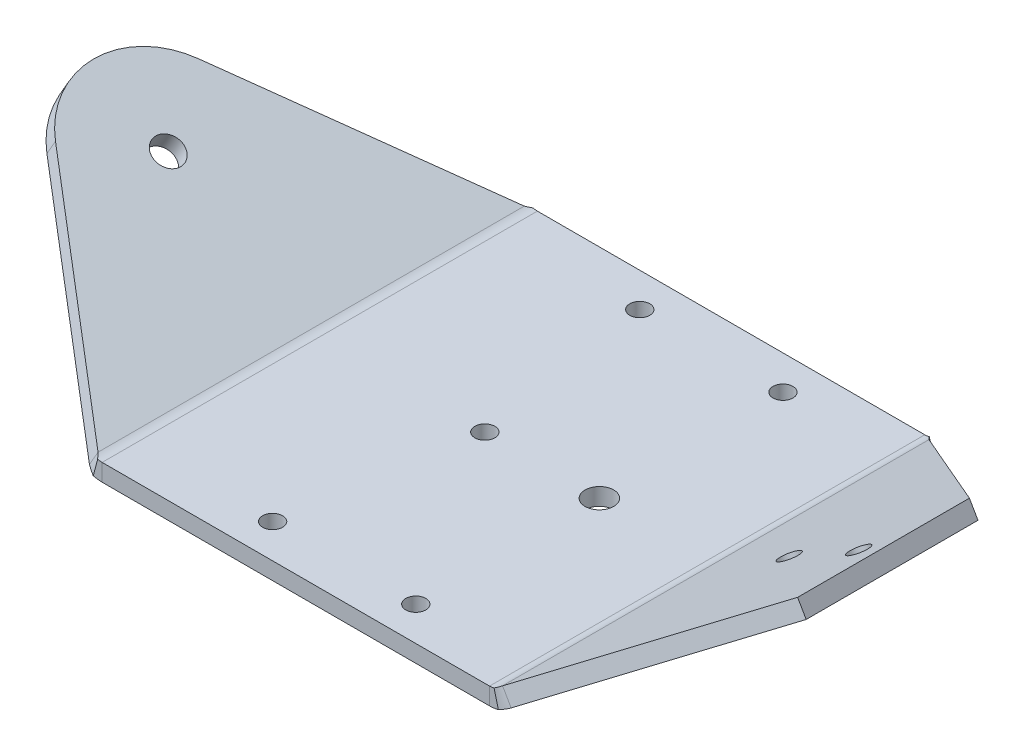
ISO-10303-21;
HEADER;
FILE_DESCRIPTION(('STEP AP214'),'2;1');
FILE_NAME('part.step','',(''),(''),'','','');
FILE_SCHEMA(('AUTOMOTIVE_DESIGN { 1 0 10303 214 1 1 1 1 }'));
ENDSEC;
DATA;
#1=APPLICATION_CONTEXT('core data for automotive mechanical design processes');
#2=APPLICATION_PROTOCOL_DEFINITION('international standard','automotive_design',2000,#1);
#3=PRODUCT_CONTEXT('',#1,'mechanical');
#4=PRODUCT('Part','Part','',(#3));
#5=PRODUCT_RELATED_PRODUCT_CATEGORY('part','',(#4));
#6=PRODUCT_DEFINITION_FORMATION('','',#4);
#7=PRODUCT_DEFINITION_CONTEXT('part definition',#1,'design');
#8=PRODUCT_DEFINITION('design','',#6,#7);
#9=PRODUCT_DEFINITION_SHAPE('','',#8);
#10=(LENGTH_UNIT() NAMED_UNIT(*) SI_UNIT(.MILLI.,.METRE.));
#11=(NAMED_UNIT(*) PLANE_ANGLE_UNIT() SI_UNIT($,.RADIAN.));
#12=(NAMED_UNIT(*) SI_UNIT($,.STERADIAN.) SOLID_ANGLE_UNIT());
#13=UNCERTAINTY_MEASURE_WITH_UNIT(LENGTH_MEASURE(1.E-05),#10,'distance_accuracy_value','');
#14=(GEOMETRIC_REPRESENTATION_CONTEXT(3) GLOBAL_UNCERTAINTY_ASSIGNED_CONTEXT((#13)) GLOBAL_UNIT_ASSIGNED_CONTEXT((#10,
#11,#12)) REPRESENTATION_CONTEXT('',''));
#15=CARTESIAN_POINT('',(0.,0.,0.));
#16=DIRECTION('',(0.,0.,1.));
#17=DIRECTION('',(1.,0.,0.));
#18=AXIS2_PLACEMENT_3D('',#15,#16,#17);
#19=CARTESIAN_POINT('',(0.,3.,0.));
#20=DIRECTION('',(0.,1.,0.));
#21=DIRECTION('',(0.,0.,1.));
#22=AXIS2_PLACEMENT_3D('',#19,#20,#21);
#23=PLANE('',#22);
#24=CARTESIAN_POINT('',(54.9999485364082,3.,32.055));
#25=DIRECTION('',(0.,1.,0.));
#26=DIRECTION('',(0.,0.,1.));
#27=AXIS2_PLACEMENT_3D('',#24,#25,#26);
#28=CIRCLE('',#27,1.75);
#29=CARTESIAN_POINT('',(54.9999485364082,3.,33.805));
#30=VERTEX_POINT('',#29);
#31=EDGE_CURVE('E629',#30,#30,#28,.T.);
#32=ORIENTED_EDGE('',*,*,#31,.F.);
#33=EDGE_LOOP('',(#32));
#34=FACE_BOUND('',#33,.T.);
#35=CARTESIAN_POINT('',(79.9999485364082,3.,0.));
#36=DIRECTION('',(0.,1.,0.));
#37=DIRECTION('',(0.,0.,1.));
#38=AXIS2_PLACEMENT_3D('',#35,#36,#37);
#39=CIRCLE('',#38,2.50000000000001);
#40=CARTESIAN_POINT('',(79.9999485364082,3.,2.50000000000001));
#41=VERTEX_POINT('',#40);
#42=EDGE_CURVE('E633',#41,#41,#39,.T.);
#43=ORIENTED_EDGE('',*,*,#42,.F.);
#44=EDGE_LOOP('',(#43));
#45=FACE_BOUND('',#44,.T.);
#46=CARTESIAN_POINT('',(59.9999485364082,3.,0.));
#47=DIRECTION('',(0.,1.,0.));
#48=DIRECTION('',(0.,0.,1.));
#49=AXIS2_PLACEMENT_3D('',#46,#47,#48);
#50=CIRCLE('',#49,1.75);
#51=CARTESIAN_POINT('',(59.9999485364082,3.,1.75));
#52=VERTEX_POINT('',#51);
#53=EDGE_CURVE('E637',#52,#52,#50,.T.);
#54=ORIENTED_EDGE('',*,*,#53,.F.);
#55=EDGE_LOOP('',(#54));
#56=FACE_BOUND('',#55,.T.);
#57=CARTESIAN_POINT('',(54.9999485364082,3.,-32.055));
#58=DIRECTION('',(0.,1.,0.));
#59=DIRECTION('',(0.,0.,1.));
#60=AXIS2_PLACEMENT_3D('',#57,#58,#59);
#61=CIRCLE('',#60,1.75);
#62=CARTESIAN_POINT('',(54.9999485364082,3.,-30.305));
#63=VERTEX_POINT('',#62);
#64=EDGE_CURVE('E641',#63,#63,#61,.T.);
#65=ORIENTED_EDGE('',*,*,#64,.F.);
#66=EDGE_LOOP('',(#65));
#67=FACE_BOUND('',#66,.T.);
#68=CARTESIAN_POINT('',(79.9999485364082,3.,-32.055));
#69=DIRECTION('',(0.,1.,0.));
#70=DIRECTION('',(0.,0.,1.));
#71=AXIS2_PLACEMENT_3D('',#68,#69,#70);
#72=CIRCLE('',#71,1.75);
#73=CARTESIAN_POINT('',(79.9999485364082,3.,-30.305));
#74=VERTEX_POINT('',#73);
#75=EDGE_CURVE('E645',#74,#74,#72,.T.);
#76=ORIENTED_EDGE('',*,*,#75,.F.);
#77=EDGE_LOOP('',(#76));
#78=FACE_BOUND('',#77,.T.);
#79=CARTESIAN_POINT('',(79.9999485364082,3.,32.055));
#80=DIRECTION('',(0.,1.,0.));
#81=DIRECTION('',(0.,0.,1.));
#82=AXIS2_PLACEMENT_3D('',#79,#80,#81);
#83=CIRCLE('',#82,1.75);
#84=CARTESIAN_POINT('',(79.9999485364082,3.,33.805));
#85=VERTEX_POINT('',#84);
#86=EDGE_CURVE('E649',#85,#85,#83,.T.);
#87=ORIENTED_EDGE('',*,*,#86,.F.);
#88=EDGE_LOOP('',(#87));
#89=FACE_BOUND('',#88,.T.);
#90=DIRECTION('',(1.,0.,0.));
#91=VECTOR('',#90,1.);
#92=CARTESIAN_POINT('',(29.9999485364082,3.,38.0000772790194));
#93=LINE('',#92,#91);
#94=CARTESIAN_POINT('',(31.1780457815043,3.00000002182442,38.0000772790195));
#95=VERTEX_POINT('',#94);
#96=CARTESIAN_POINT('',(98.821851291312,3.,38.0000772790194));
#97=VERTEX_POINT('',#96);
#98=EDGE_CURVE('E652',#95,#97,#93,.T.);
#99=ORIENTED_EDGE('',*,*,#98,.T.);
#100=DIRECTION('',(0.,0.,-1.));
#101=VECTOR('',#100,1.);
#102=CARTESIAN_POINT('',(98.821851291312,3.,0.));
#103=LINE('',#102,#101);
#104=CARTESIAN_POINT('',(98.821851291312,2.99999993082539,-38.0000772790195));
#105=VERTEX_POINT('',#104);
#106=EDGE_CURVE('E443',#97,#105,#103,.T.);
#107=ORIENTED_EDGE('',*,*,#106,.T.);
#108=DIRECTION('',(-1.,0.,0.));
#109=VECTOR('',#108,1.);
#110=CARTESIAN_POINT('',(29.9999485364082,3.,-38.0000772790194));
#111=LINE('',#110,#109);
#112=CARTESIAN_POINT('',(31.1780457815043,3.,-38.0000772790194));
#113=VERTEX_POINT('',#112);
#114=EDGE_CURVE('E657',#105,#113,#111,.T.);
#115=ORIENTED_EDGE('',*,*,#114,.T.);
#116=DIRECTION('',(0.,0.,1.));
#117=VECTOR('',#116,1.);
#118=CARTESIAN_POINT('',(31.1780457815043,3.,0.));
#119=LINE('',#118,#117);
#120=EDGE_CURVE('E655',#113,#95,#119,.T.);
#121=ORIENTED_EDGE('',*,*,#120,.T.);
#122=EDGE_LOOP('',(#99,#107,#115,#121));
#123=FACE_BOUND('',#122,.T.);
#124=ADVANCED_FACE('F70',(#34,#45,#56,#67,#78,#89,#123),#23,.T.);
#125=CARTESIAN_POINT('',(0.,0.,0.));
#126=DIRECTION('',(0.,1.,0.));
#127=DIRECTION('',(0.,0.,1.));
#128=AXIS2_PLACEMENT_3D('',#125,#126,#127);
#129=PLANE('',#128);
#130=DIRECTION('',(0.,0.,-1.));
#131=VECTOR('',#130,1.);
#132=CARTESIAN_POINT('',(98.821851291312,0.,0.));
#133=LINE('',#132,#131);
#134=CARTESIAN_POINT('',(98.821851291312,0.,38.0000772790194));
#135=VERTEX_POINT('',#134);
#136=CARTESIAN_POINT('',(98.821851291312,0.,-38.0000772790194));
#137=VERTEX_POINT('',#136);
#138=EDGE_CURVE('E81',#135,#137,#133,.T.);
#139=ORIENTED_EDGE('',*,*,#138,.F.);
#140=DIRECTION('',(1.,0.,0.));
#141=VECTOR('',#140,1.);
#142=CARTESIAN_POINT('',(29.9999485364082,0.,38.0000772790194));
#143=LINE('',#142,#141);
#144=CARTESIAN_POINT('',(31.1780457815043,0.,38.0000772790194));
#145=VERTEX_POINT('',#144);
#146=EDGE_CURVE('E97',#145,#135,#143,.T.);
#147=ORIENTED_EDGE('',*,*,#146,.F.);
#148=DIRECTION('',(0.,0.,1.));
#149=VECTOR('',#148,1.);
#150=CARTESIAN_POINT('',(31.1780457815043,0.,0.));
#151=LINE('',#150,#149);
#152=CARTESIAN_POINT('',(31.1780457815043,0.,-38.0000772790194));
#153=VERTEX_POINT('',#152);
#154=EDGE_CURVE('E978',#153,#145,#151,.T.);
#155=ORIENTED_EDGE('',*,*,#154,.F.);
#156=DIRECTION('',(-1.,0.,0.));
#157=VECTOR('',#156,1.);
#158=CARTESIAN_POINT('',(29.9999485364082,0.,-38.0000772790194));
#159=LINE('',#158,#157);
#160=EDGE_CURVE('E89',#137,#153,#159,.T.);
#161=ORIENTED_EDGE('',*,*,#160,.F.);
#162=EDGE_LOOP('',(#139,#147,#155,#161));
#163=FACE_BOUND('',#162,.T.);
#164=CARTESIAN_POINT('',(54.9999485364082,0.,32.055));
#165=DIRECTION('',(0.,1.,0.));
#166=DIRECTION('',(0.,0.,1.));
#167=AXIS2_PLACEMENT_3D('',#164,#165,#166);
#168=CIRCLE('',#167,1.75);
#169=CARTESIAN_POINT('',(54.9999485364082,0.,33.805));
#170=VERTEX_POINT('',#169);
#171=EDGE_CURVE('E1173',#170,#170,#168,.T.);
#172=ORIENTED_EDGE('',*,*,#171,.T.);
#173=EDGE_LOOP('',(#172));
#174=FACE_BOUND('',#173,.T.);
#175=CARTESIAN_POINT('',(79.9999485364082,0.,0.));
#176=DIRECTION('',(0.,1.,0.));
#177=DIRECTION('',(0.,0.,1.));
#178=AXIS2_PLACEMENT_3D('',#175,#176,#177);
#179=CIRCLE('',#178,2.50000000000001);
#180=CARTESIAN_POINT('',(79.9999485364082,0.,2.50000000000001));
#181=VERTEX_POINT('',#180);
#182=EDGE_CURVE('E1161',#181,#181,#179,.T.);
#183=ORIENTED_EDGE('',*,*,#182,.T.);
#184=EDGE_LOOP('',(#183));
#185=FACE_BOUND('',#184,.T.);
#186=CARTESIAN_POINT('',(59.9999485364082,0.,0.));
#187=DIRECTION('',(0.,1.,0.));
#188=DIRECTION('',(0.,0.,1.));
#189=AXIS2_PLACEMENT_3D('',#186,#187,#188);
#190=CIRCLE('',#189,1.75);
#191=CARTESIAN_POINT('',(59.9999485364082,0.,1.75));
#192=VERTEX_POINT('',#191);
#193=EDGE_CURVE('E1155',#192,#192,#190,.T.);
#194=ORIENTED_EDGE('',*,*,#193,.T.);
#195=EDGE_LOOP('',(#194));
#196=FACE_BOUND('',#195,.T.);
#197=CARTESIAN_POINT('',(54.9999485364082,0.,-32.055));
#198=DIRECTION('',(0.,1.,0.));
#199=DIRECTION('',(0.,0.,1.));
#200=AXIS2_PLACEMENT_3D('',#197,#198,#199);
#201=CIRCLE('',#200,1.75);
#202=CARTESIAN_POINT('',(54.9999485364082,0.,-30.305));
#203=VERTEX_POINT('',#202);
#204=EDGE_CURVE('E1165',#203,#203,#201,.T.);
#205=ORIENTED_EDGE('',*,*,#204,.T.);
#206=EDGE_LOOP('',(#205));
#207=FACE_BOUND('',#206,.T.);
#208=CARTESIAN_POINT('',(79.9999485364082,0.,-32.055));
#209=DIRECTION('',(0.,1.,0.));
#210=DIRECTION('',(0.,0.,1.));
#211=AXIS2_PLACEMENT_3D('',#208,#209,#210);
#212=CIRCLE('',#211,1.75);
#213=CARTESIAN_POINT('',(79.9999485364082,0.,-30.305));
#214=VERTEX_POINT('',#213);
#215=EDGE_CURVE('E1169',#214,#214,#212,.T.);
#216=ORIENTED_EDGE('',*,*,#215,.T.);
#217=EDGE_LOOP('',(#216));
#218=FACE_BOUND('',#217,.T.);
#219=CARTESIAN_POINT('',(79.9999485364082,0.,32.055));
#220=DIRECTION('',(0.,1.,0.));
#221=DIRECTION('',(0.,0.,1.));
#222=AXIS2_PLACEMENT_3D('',#219,#220,#221);
#223=CIRCLE('',#222,1.75);
#224=CARTESIAN_POINT('',(79.9999485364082,0.,33.805));
#225=VERTEX_POINT('',#224);
#226=EDGE_CURVE('E581',#225,#225,#223,.T.);
#227=ORIENTED_EDGE('',*,*,#226,.T.);
#228=EDGE_LOOP('',(#227));
#229=FACE_BOUND('',#228,.T.);
#230=ADVANCED_FACE('F72',(#163,#174,#185,#196,#207,#218,#229),#129,.F.);
#231=CARTESIAN_POINT('',(29.9999485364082,3.,38.0000772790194));
#232=DIRECTION('',(0.,0.,-1.));
#233=DIRECTION('',(-1.,0.,0.));
#234=AXIS2_PLACEMENT_3D('',#231,#232,#233);
#235=PLANE('',#234);
#236=DIRECTION('',(0.,-1.,0.));
#237=VECTOR('',#236,1.);
#238=CARTESIAN_POINT('',(98.821851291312,3.,38.0000772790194));
#239=LINE('',#238,#237);
#240=EDGE_CURVE('E660',#97,#135,#239,.T.);
#241=ORIENTED_EDGE('',*,*,#240,.F.);
#242=ORIENTED_EDGE('',*,*,#98,.F.);
#243=DIRECTION('',(0.,1.,0.));
#244=VECTOR('',#243,1.);
#245=CARTESIAN_POINT('',(31.1780457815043,3.,38.0000772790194));
#246=LINE('',#245,#244);
#247=EDGE_CURVE('E663',#145,#95,#246,.T.);
#248=ORIENTED_EDGE('',*,*,#247,.F.);
#249=ORIENTED_EDGE('',*,*,#146,.T.);
#250=EDGE_LOOP('',(#241,#242,#248,#249));
#251=FACE_BOUND('',#250,.T.);
#252=ADVANCED_FACE('F616',(#251),#235,.F.);
#253=CARTESIAN_POINT('',(29.9999485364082,3.,-38.0000772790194));
#254=DIRECTION('',(0.,0.,1.));
#255=DIRECTION('',(1.,0.,0.));
#256=AXIS2_PLACEMENT_3D('',#253,#254,#255);
#257=PLANE('',#256);
#258=DIRECTION('',(0.,1.,0.));
#259=VECTOR('',#258,1.);
#260=CARTESIAN_POINT('',(98.821851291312,3.,-38.0000772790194));
#261=LINE('',#260,#259);
#262=EDGE_CURVE('E12',#137,#105,#261,.T.);
#263=ORIENTED_EDGE('',*,*,#262,.F.);
#264=ORIENTED_EDGE('',*,*,#160,.T.);
#265=DIRECTION('',(0.,-1.,0.));
#266=VECTOR('',#265,1.);
#267=CARTESIAN_POINT('',(31.1780457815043,3.,-38.0000772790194));
#268=LINE('',#267,#266);
#269=EDGE_CURVE('E975',#113,#153,#268,.T.);
#270=ORIENTED_EDGE('',*,*,#269,.F.);
#271=ORIENTED_EDGE('',*,*,#114,.F.);
#272=EDGE_LOOP('',(#263,#264,#270,#271));
#273=FACE_BOUND('',#272,.T.);
#274=ADVANCED_FACE('F614',(#273),#257,.F.);
#275=CARTESIAN_POINT('',(59.9999485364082,3.,0.));
#276=DIRECTION('',(0.,-1.,0.));
#277=DIRECTION('',(0.,0.,-1.));
#278=AXIS2_PLACEMENT_3D('',#275,#276,#277);
#279=CYLINDRICAL_SURFACE('',#278,1.75);
#280=ORIENTED_EDGE('',*,*,#53,.T.);
#281=EDGE_LOOP('',(#280));
#282=FACE_BOUND('',#281,.T.);
#283=ORIENTED_EDGE('',*,*,#193,.F.);
#284=EDGE_LOOP('',(#283));
#285=FACE_BOUND('',#284,.T.);
#286=ADVANCED_FACE('F610',(#282,#285),#279,.F.);
#287=CARTESIAN_POINT('',(79.9999485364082,3.,0.));
#288=DIRECTION('',(0.,-1.,0.));
#289=DIRECTION('',(0.,0.,-1.));
#290=AXIS2_PLACEMENT_3D('',#287,#288,#289);
#291=CYLINDRICAL_SURFACE('',#290,2.50000000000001);
#292=ORIENTED_EDGE('',*,*,#42,.T.);
#293=EDGE_LOOP('',(#292));
#294=FACE_BOUND('',#293,.T.);
#295=ORIENTED_EDGE('',*,*,#182,.F.);
#296=EDGE_LOOP('',(#295));
#297=FACE_BOUND('',#296,.T.);
#298=ADVANCED_FACE('F606',(#294,#297),#291,.F.);
#299=CARTESIAN_POINT('',(54.9999485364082,3.,-32.055));
#300=DIRECTION('',(0.,-1.,0.));
#301=DIRECTION('',(0.,0.,-1.));
#302=AXIS2_PLACEMENT_3D('',#299,#300,#301);
#303=CYLINDRICAL_SURFACE('',#302,1.75);
#304=ORIENTED_EDGE('',*,*,#64,.T.);
#305=EDGE_LOOP('',(#304));
#306=FACE_BOUND('',#305,.T.);
#307=ORIENTED_EDGE('',*,*,#204,.F.);
#308=EDGE_LOOP('',(#307));
#309=FACE_BOUND('',#308,.T.);
#310=ADVANCED_FACE('F602',(#306,#309),#303,.F.);
#311=CARTESIAN_POINT('',(79.9999485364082,3.,-32.055));
#312=DIRECTION('',(0.,-1.,0.));
#313=DIRECTION('',(0.,0.,-1.));
#314=AXIS2_PLACEMENT_3D('',#311,#312,#313);
#315=CYLINDRICAL_SURFACE('',#314,1.75);
#316=ORIENTED_EDGE('',*,*,#75,.T.);
#317=EDGE_LOOP('',(#316));
#318=FACE_BOUND('',#317,.T.);
#319=ORIENTED_EDGE('',*,*,#215,.F.);
#320=EDGE_LOOP('',(#319));
#321=FACE_BOUND('',#320,.T.);
#322=ADVANCED_FACE('F598',(#318,#321),#315,.F.);
#323=CARTESIAN_POINT('',(54.9999485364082,3.,32.055));
#324=DIRECTION('',(0.,-1.,0.));
#325=DIRECTION('',(0.,0.,-1.));
#326=AXIS2_PLACEMENT_3D('',#323,#324,#325);
#327=CYLINDRICAL_SURFACE('',#326,1.75);
#328=ORIENTED_EDGE('',*,*,#31,.T.);
#329=EDGE_LOOP('',(#328));
#330=FACE_BOUND('',#329,.T.);
#331=ORIENTED_EDGE('',*,*,#171,.F.);
#332=EDGE_LOOP('',(#331));
#333=FACE_BOUND('',#332,.T.);
#334=ADVANCED_FACE('F594',(#330,#333),#327,.F.);
#335=CARTESIAN_POINT('',(79.9999485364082,3.,32.055));
#336=DIRECTION('',(0.,-1.,0.));
#337=DIRECTION('',(0.,0.,-1.));
#338=AXIS2_PLACEMENT_3D('',#335,#336,#337);
#339=CYLINDRICAL_SURFACE('',#338,1.75);
#340=ORIENTED_EDGE('',*,*,#86,.T.);
#341=EDGE_LOOP('',(#340));
#342=FACE_BOUND('',#341,.T.);
#343=ORIENTED_EDGE('',*,*,#226,.F.);
#344=EDGE_LOOP('',(#343));
#345=FACE_BOUND('',#344,.T.);
#346=ADVANCED_FACE('F591',(#342,#345),#339,.F.);
#347=CARTESIAN_POINT('',(31.1780457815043,5.99999997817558,-38.0000772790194));
#348=DIRECTION('',(0.,0.,1.));
#349=DIRECTION('',(1.,0.,0.));
#350=AXIS2_PLACEMENT_3D('',#347,#348,#349);
#351=PLANE('',#350);
#352=ORIENTED_EDGE('',*,*,#269,.T.);
#353=CARTESIAN_POINT('',(31.1780457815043,6.,-38.0000772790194));
#354=DIRECTION('',(0.,0.,1.));
#355=DIRECTION('',(1.,0.,0.));
#356=AXIS2_PLACEMENT_3D('',#353,#354,#355);
#357=CIRCLE('',#356,5.99999997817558);
#358=CARTESIAN_POINT('',(29.6251315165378,0.204445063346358,-38.0000772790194));
#359=VERTEX_POINT('',#358);
#360=EDGE_CURVE('E475',#153,#359,#357,.F.);
#361=ORIENTED_EDGE('',*,*,#360,.T.);
#362=CARTESIAN_POINT('',(30.4015886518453,3.10222254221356,-38.0000772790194));
#363=CARTESIAN_POINT('',(29.6251315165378,0.204445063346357,-38.0000772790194));
#364=B_SPLINE_CURVE_WITH_KNOTS('',1,(#362,#363),.UNSPECIFIED.,.F.,.F.,(2,2),(0.,1.),.UNSPECIFIED.);
#365=CARTESIAN_POINT('',(30.4015886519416,3.10222254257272,-38.0000772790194));
#366=VERTEX_POINT('',#365);
#367=EDGE_CURVE('E542',#359,#366,#364,.F.);
#368=ORIENTED_EDGE('',*,*,#367,.T.);
#369=CARTESIAN_POINT('',(31.1780457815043,5.99999997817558,-38.0000772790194));
#370=DIRECTION('',(0.,0.,-1.));
#371=DIRECTION('',(-1.,0.,0.));
#372=AXIS2_PLACEMENT_3D('',#369,#370,#371);
#373=CIRCLE('',#372,2.99999995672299);
#374=EDGE_CURVE('E977',#113,#366,#373,.T.);
#375=ORIENTED_EDGE('',*,*,#374,.F.);
#376=EDGE_LOOP('',(#352,#361,#368,#375));
#377=FACE_BOUND('',#376,.T.);
#378=ADVANCED_FACE('F510',(#377),#351,.F.);
#379=CARTESIAN_POINT('',(29.6251315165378,0.204445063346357,-38.0000772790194));
#380=CARTESIAN_POINT('',(29.1193201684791,0.339976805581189,-37.7385334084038));
#381=CARTESIAN_POINT('',(28.6315438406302,0.542020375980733,-37.4770729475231));
#382=CARTESIAN_POINT('',(28.1780457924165,0.803847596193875,-37.2155290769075));
#383=CARTESIAN_POINT('',(30.4015886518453,3.10222254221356,-38.0000772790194));
#384=CARTESIAN_POINT('',(30.1486925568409,3.16998584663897,-37.7385433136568));
#385=CARTESIAN_POINT('',(29.9047862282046,3.27101515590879,-37.4770630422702));
#386=CARTESIAN_POINT('',(29.6780457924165,3.40192380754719,-37.2155290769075));
#387=B_SPLINE_SURFACE_WITH_KNOTS('',1,3,((#379,#380,#381,#382),(#383,#384,#385,#386)),
.UNSPECIFIED.,.F.,.F.,.F.,(2,2),(4,4),(0.,1.),(0.,1.),.UNSPECIFIED.);
#388=CARTESIAN_POINT('',(29.6251315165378,0.204445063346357,-38.0000772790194));
#389=CARTESIAN_POINT('',(29.1193201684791,0.339976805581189,-37.7385334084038));
#390=CARTESIAN_POINT('',(28.6315438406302,0.542020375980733,-37.4770729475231));
#391=CARTESIAN_POINT('',(28.1780457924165,0.803847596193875,-37.2155290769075));
#392=B_SPLINE_CURVE_WITH_KNOTS('',3,(#388,#389,#390,#391),.UNSPECIFIED.,.F.,.F.,(4,4),(0.,1.),.UNSPECIFIED.);
#393=CARTESIAN_POINT('',(28.1780457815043,0.803847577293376,-37.2155290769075));
#394=VERTEX_POINT('',#393);
#395=EDGE_CURVE('E483',#359,#394,#392,.T.);
#396=CARTESIAN_POINT('',(28.1780457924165,0.803847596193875,-37.2155290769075));
#397=CARTESIAN_POINT('',(29.6780457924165,3.40192380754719,-37.2155290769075));
#398=B_SPLINE_CURVE_WITH_KNOTS('',1,(#396,#397),.UNSPECIFIED.,.F.,.F.,(2,2),(0.,1.),.UNSPECIFIED.);
#399=CARTESIAN_POINT('',(29.6780457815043,3.40192378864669,-37.2155290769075));
#400=VERTEX_POINT('',#399);
#401=EDGE_CURVE('E428',#400,#394,#398,.F.);
#402=CARTESIAN_POINT('',(29.6780457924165,3.40192380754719,-37.2155290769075));
#403=CARTESIAN_POINT('',(29.9047862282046,3.27101515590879,-37.4770630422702));
#404=CARTESIAN_POINT('',(30.1486925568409,3.16998584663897,-37.7385433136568));
#405=CARTESIAN_POINT('',(30.4015886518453,3.10222254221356,-38.0000772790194));
#406=B_SPLINE_CURVE_WITH_KNOTS('',3,(#402,#403,#404,#405),.UNSPECIFIED.,.F.,.F.,(4,4),(0.,1.),.UNSPECIFIED.);
#407=EDGE_CURVE('E491',#366,#400,#406,.F.);
#408=ORIENTED_EDGE('',*,*,#367,.F.);
#409=ORIENTED_EDGE('',*,*,#395,.T.);
#410=ORIENTED_EDGE('',*,*,#401,.F.);
#411=ORIENTED_EDGE('',*,*,#407,.F.);
#412=EDGE_LOOP('',(#408,#409,#410,#411));
#413=FACE_BOUND('',#412,.T.);
#414=ADVANCED_FACE('F498',(#413),#387,.F.);
#415=CARTESIAN_POINT('',(28.1780457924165,0.803847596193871,37.2155290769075));
#416=CARTESIAN_POINT('',(28.6315438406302,0.542020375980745,37.4770729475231));
#417=CARTESIAN_POINT('',(29.1193201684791,0.339976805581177,37.7385334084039));
#418=CARTESIAN_POINT('',(29.6251315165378,0.204445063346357,38.0000772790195));
#419=CARTESIAN_POINT('',(29.6780457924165,3.40192380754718,37.2155290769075));
#420=CARTESIAN_POINT('',(29.9047862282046,3.27101515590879,37.4770630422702));
#421=CARTESIAN_POINT('',(30.1486925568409,3.16998584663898,37.7385433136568));
#422=CARTESIAN_POINT('',(30.4015886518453,3.10222254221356,38.0000772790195));
#423=B_SPLINE_SURFACE_WITH_KNOTS('',1,3,((#415,#416,#417,#418),(#419,#420,#421,#422)),
.UNSPECIFIED.,.F.,.F.,.F.,(2,2),(4,4),(0.,1.),(0.,1.),.UNSPECIFIED.);
#424=CARTESIAN_POINT('',(29.6780457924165,3.40192380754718,37.2155290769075));
#425=CARTESIAN_POINT('',(28.1780457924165,0.803847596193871,37.2155290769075));
#426=B_SPLINE_CURVE_WITH_KNOTS('',1,(#424,#425),.UNSPECIFIED.,.F.,.F.,(2,2),(0.,1.),.UNSPECIFIED.);
#427=CARTESIAN_POINT('',(28.1780457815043,0.803847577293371,37.2155290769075));
#428=VERTEX_POINT('',#427);
#429=CARTESIAN_POINT('',(29.6780457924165,3.40192380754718,37.2155290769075));
#430=VERTEX_POINT('',#429);
#431=EDGE_CURVE('E432',#428,#430,#426,.F.);
#432=CARTESIAN_POINT('',(28.1780457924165,0.803847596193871,37.2155290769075));
#433=CARTESIAN_POINT('',(28.6315438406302,0.542020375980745,37.4770729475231));
#434=CARTESIAN_POINT('',(29.1193201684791,0.339976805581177,37.7385334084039));
#435=CARTESIAN_POINT('',(29.6251315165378,0.204445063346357,38.0000772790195));
#436=B_SPLINE_CURVE_WITH_KNOTS('',3,(#432,#433,#434,#435),.UNSPECIFIED.,.F.,.F.,(4,4),(0.,1.),.UNSPECIFIED.);
#437=CARTESIAN_POINT('',(29.6251315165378,0.204445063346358,38.0000772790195));
#438=VERTEX_POINT('',#437);
#439=EDGE_CURVE('E984',#428,#438,#436,.T.);
#440=CARTESIAN_POINT('',(29.6251315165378,0.204445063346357,38.0000772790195));
#441=CARTESIAN_POINT('',(30.4015886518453,3.10222254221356,38.0000772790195));
#442=B_SPLINE_CURVE_WITH_KNOTS('',1,(#440,#441),.UNSPECIFIED.,.F.,.F.,(2,2),(0.,1.),.UNSPECIFIED.);
#443=CARTESIAN_POINT('',(30.4015886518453,3.10222254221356,38.0000772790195));
#444=VERTEX_POINT('',#443);
#445=EDGE_CURVE('E564',#438,#444,#442,.T.);
#446=CARTESIAN_POINT('',(30.4015886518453,3.10222254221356,38.0000772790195));
#447=CARTESIAN_POINT('',(30.1486925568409,3.16998584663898,37.7385433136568));
#448=CARTESIAN_POINT('',(29.9047862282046,3.27101515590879,37.4770630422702));
#449=CARTESIAN_POINT('',(29.6780457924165,3.40192380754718,37.2155290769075));
#450=B_SPLINE_CURVE_WITH_KNOTS('',3,(#446,#447,#448,#449),.UNSPECIFIED.,.F.,.F.,(4,4),(0.,1.),.UNSPECIFIED.);
#451=EDGE_CURVE('E992',#430,#444,#450,.F.);
#452=ORIENTED_EDGE('',*,*,#431,.F.);
#453=ORIENTED_EDGE('',*,*,#439,.T.);
#454=ORIENTED_EDGE('',*,*,#445,.T.);
#455=ORIENTED_EDGE('',*,*,#451,.F.);
#456=EDGE_LOOP('',(#452,#453,#454,#455));
#457=FACE_BOUND('',#456,.T.);
#458=ADVANCED_FACE('F509',(#457),#423,.F.);
#459=CARTESIAN_POINT('',(31.1780457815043,5.99999997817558,38.0000772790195));
#460=DIRECTION('',(0.,0.,-1.));
#461=DIRECTION('',(-1.,0.,0.));
#462=AXIS2_PLACEMENT_3D('',#459,#460,#461);
#463=PLANE('',#462);
#464=CARTESIAN_POINT('',(31.1780457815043,6.,38.0000772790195));
#465=DIRECTION('',(0.,0.,1.));
#466=DIRECTION('',(1.,0.,0.));
#467=AXIS2_PLACEMENT_3D('',#464,#465,#466);
#468=CIRCLE('',#467,5.99999997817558);
#469=EDGE_CURVE('E985',#438,#145,#468,.T.);
#470=ORIENTED_EDGE('',*,*,#469,.T.);
#471=ORIENTED_EDGE('',*,*,#247,.T.);
#472=CARTESIAN_POINT('',(31.1780457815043,5.99999997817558,38.0000772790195));
#473=DIRECTION('',(0.,0.,1.));
#474=DIRECTION('',(1.,0.,0.));
#475=AXIS2_PLACEMENT_3D('',#472,#473,#474);
#476=CIRCLE('',#475,2.99999995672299);
#477=EDGE_CURVE('E1024',#444,#95,#476,.T.);
#478=ORIENTED_EDGE('',*,*,#477,.F.);
#479=ORIENTED_EDGE('',*,*,#445,.F.);
#480=EDGE_LOOP('',(#470,#471,#478,#479));
#481=FACE_BOUND('',#480,.T.);
#482=ADVANCED_FACE('F459',(#481),#463,.F.);
#483=CARTESIAN_POINT('',(31.1780457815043,6.,-76.0958286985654));
#484=DIRECTION('',(0.,0.,1.));
#485=DIRECTION('',(1.,0.,0.));
#486=AXIS2_PLACEMENT_3D('',#483,#484,#485);
#487=CYLINDRICAL_SURFACE('',#486,2.99999997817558);
#488=ORIENTED_EDGE('',*,*,#451,.T.);
#489=ORIENTED_EDGE('',*,*,#477,.T.);
#490=ORIENTED_EDGE('',*,*,#120,.F.);
#491=ORIENTED_EDGE('',*,*,#374,.T.);
#492=ORIENTED_EDGE('',*,*,#407,.T.);
#493=DIRECTION('',(0.,0.,1.));
#494=VECTOR('',#493,1.);
#495=CARTESIAN_POINT('',(29.6780457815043,3.40192378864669,0.));
#496=LINE('',#495,#494);
#497=EDGE_CURVE('E1019',#400,#430,#496,.T.);
#498=ORIENTED_EDGE('',*,*,#497,.T.);
#499=EDGE_LOOP('',(#488,#489,#490,#491,#492,#498));
#500=FACE_BOUND('',#499,.T.);
#501=ADVANCED_FACE('F457',(#500),#487,.F.);
#502=CARTESIAN_POINT('',(31.1780457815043,6.,-76.0958286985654));
#503=DIRECTION('',(0.,0.,1.));
#504=DIRECTION('',(1.,0.,0.));
#505=AXIS2_PLACEMENT_3D('',#502,#503,#504);
#506=CYLINDRICAL_SURFACE('',#505,5.99999997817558);
#507=ORIENTED_EDGE('',*,*,#439,.F.);
#508=DIRECTION('',(0.,0.,1.));
#509=VECTOR('',#508,1.);
#510=CARTESIAN_POINT('',(28.1780457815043,0.803847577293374,0.));
#511=LINE('',#510,#509);
#512=EDGE_CURVE('E414',#394,#428,#511,.T.);
#513=ORIENTED_EDGE('',*,*,#512,.F.);
#514=ORIENTED_EDGE('',*,*,#395,.F.);
#515=ORIENTED_EDGE('',*,*,#360,.F.);
#516=ORIENTED_EDGE('',*,*,#154,.T.);
#517=ORIENTED_EDGE('',*,*,#469,.F.);
#518=EDGE_LOOP('',(#507,#513,#514,#515,#516,#517));
#519=FACE_BOUND('',#518,.T.);
#520=ADVANCED_FACE('F391',(#519),#506,.T.);
#521=CARTESIAN_POINT('',(4.71759037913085,17.8128494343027,0.));
#522=DIRECTION('',(-0.500000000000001,-0.866025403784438,0.));
#523=DIRECTION('',(0.,0.,-1.));
#524=AXIS2_PLACEMENT_3D('',#521,#522,#523);
#525=CYLINDRICAL_SURFACE('',#524,2.5);
#526=CARTESIAN_POINT('',(4.71759037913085,17.8128494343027,0.));
#527=DIRECTION('',(0.500000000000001,0.866025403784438,0.));
#528=DIRECTION('',(0.,0.,1.));
#529=AXIS2_PLACEMENT_3D('',#526,#527,#528);
#530=CIRCLE('',#529,2.5);
#531=CARTESIAN_POINT('',(4.71759037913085,17.8128494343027,2.5));
#532=VERTEX_POINT('',#531);
#533=EDGE_CURVE('E1035',#532,#532,#530,.T.);
#534=ORIENTED_EDGE('',*,*,#533,.T.);
#535=EDGE_LOOP('',(#534));
#536=FACE_BOUND('',#535,.T.);
#537=CARTESIAN_POINT('',(3.21759037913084,15.2147732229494,0.));
#538=DIRECTION('',(0.500000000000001,0.866025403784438,0.));
#539=DIRECTION('',(0.,0.,1.));
#540=AXIS2_PLACEMENT_3D('',#537,#538,#539);
#541=CIRCLE('',#540,2.5);
#542=CARTESIAN_POINT('',(3.21759037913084,15.2147732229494,2.5));
#543=VERTEX_POINT('',#542);
#544=EDGE_CURVE('E423',#543,#543,#541,.T.);
#545=ORIENTED_EDGE('',*,*,#544,.F.);
#546=EDGE_LOOP('',(#545));
#547=FACE_BOUND('',#546,.T.);
#548=ADVANCED_FACE('F387',(#536,#547),#525,.F.);
#549=CARTESIAN_POINT('',(4.71759037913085,17.8128494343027,0.));
#550=DIRECTION('',(-0.500000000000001,-0.866025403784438,0.));
#551=DIRECTION('',(0.,0.,-1.));
#552=AXIS2_PLACEMENT_3D('',#549,#550,#551);
#553=CYLINDRICAL_SURFACE('',#552,15.);
#554=CARTESIAN_POINT('',(3.21759037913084,15.2147732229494,0.));
#555=DIRECTION('',(0.500000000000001,0.866025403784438,0.));
#556=DIRECTION('',(0.,0.,1.));
#557=AXIS2_PLACEMENT_3D('',#554,#555,#556);
#558=CIRCLE('',#557,15.);
#559=CARTESIAN_POINT('',(-3.98277515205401,19.3719062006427,-12.4849101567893));
#560=VERTEX_POINT('',#559);
#561=CARTESIAN_POINT('',(-3.98277515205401,19.3719062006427,12.4849101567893));
#562=VERTEX_POINT('',#561);
#563=EDGE_CURVE('E1043',#560,#562,#558,.T.);
#564=ORIENTED_EDGE('',*,*,#563,.T.);
#565=DIRECTION('',(-0.500000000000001,-0.866025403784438,0.));
#566=VECTOR('',#565,1.);
#567=CARTESIAN_POINT('',(-2.48277515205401,21.969982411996,12.4849101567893));
#568=LINE('',#567,#566);
#569=CARTESIAN_POINT('',(-2.48277515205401,21.969982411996,12.4849101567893));
#570=VERTEX_POINT('',#569);
#571=EDGE_CURVE('E377',#570,#562,#568,.T.);
#572=ORIENTED_EDGE('',*,*,#571,.F.);
#573=CARTESIAN_POINT('',(4.71759037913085,17.8128494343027,0.));
#574=DIRECTION('',(0.500000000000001,0.866025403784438,0.));
#575=DIRECTION('',(0.,0.,1.));
#576=AXIS2_PLACEMENT_3D('',#573,#574,#575);
#577=CIRCLE('',#576,15.);
#578=CARTESIAN_POINT('',(-2.48277515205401,21.969982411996,-12.4849101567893));
#579=VERTEX_POINT('',#578);
#580=EDGE_CURVE('E1049',#579,#570,#577,.T.);
#581=ORIENTED_EDGE('',*,*,#580,.F.);
#582=DIRECTION('',(-0.500000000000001,-0.866025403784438,0.));
#583=VECTOR('',#582,1.);
#584=CARTESIAN_POINT('',(-2.48277515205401,21.969982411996,-12.4849101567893));
#585=LINE('',#584,#583);
#586=EDGE_CURVE('E1045',#579,#560,#585,.T.);
#587=ORIENTED_EDGE('',*,*,#586,.T.);
#588=EDGE_LOOP('',(#564,#572,#581,#587));
#589=FACE_BOUND('',#588,.T.);
#590=ADVANCED_FACE('F390',(#589),#553,.T.);
#591=CARTESIAN_POINT('',(4.71759037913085,17.8128494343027,0.));
#592=DIRECTION('',(0.500000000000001,0.866025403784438,0.));
#593=DIRECTION('',(0.,0.,1.));
#594=AXIS2_PLACEMENT_3D('',#591,#592,#593);
#595=PLANE('',#594);
#596=ORIENTED_EDGE('',*,*,#497,.F.);
#597=DIRECTION('',(-0.720816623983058,0.416163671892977,0.554284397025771));
#598=VECTOR('',#597,1.);
#599=CARTESIAN_POINT('',(30.6983079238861,2.8128751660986,-38.0000772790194));
#600=LINE('',#599,#598);
#601=EDGE_CURVE('E1048',#400,#579,#600,.T.);
#602=ORIENTED_EDGE('',*,*,#601,.T.);
#603=ORIENTED_EDGE('',*,*,#580,.T.);
#604=DIRECTION('',(0.720816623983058,-0.416163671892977,0.554284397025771));
#605=VECTOR('',#604,1.);
#606=CARTESIAN_POINT('',(30.6983079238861,2.8128751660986,38.0000772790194));
#607=LINE('',#606,#605);
#608=EDGE_CURVE('E1050',#570,#430,#607,.T.);
#609=ORIENTED_EDGE('',*,*,#608,.T.);
#610=EDGE_LOOP('',(#596,#602,#603,#609));
#611=FACE_BOUND('',#610,.T.);
#612=ORIENTED_EDGE('',*,*,#533,.F.);
#613=EDGE_LOOP('',(#612));
#614=FACE_BOUND('',#613,.T.);
#615=ADVANCED_FACE('F395',(#611,#614),#595,.T.);
#616=CARTESIAN_POINT('',(30.6983079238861,2.8128751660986,-38.0000772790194));
#617=DIRECTION('',(0.480024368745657,-0.277142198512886,0.832327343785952));
#618=DIRECTION('',(0.720816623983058,-0.416163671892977,-0.554284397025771));
#619=AXIS2_PLACEMENT_3D('',#616,#617,#618);
#620=PLANE('',#619);
#621=ORIENTED_EDGE('',*,*,#601,.F.);
#622=ORIENTED_EDGE('',*,*,#401,.T.);
#623=DIRECTION('',(-0.720816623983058,0.416163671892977,0.554284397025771));
#624=VECTOR('',#623,1.);
#625=CARTESIAN_POINT('',(29.1983079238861,0.214798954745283,-38.0000772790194));
#626=LINE('',#625,#624);
#627=EDGE_CURVE('E426',#394,#560,#626,.T.);
#628=ORIENTED_EDGE('',*,*,#627,.T.);
#629=ORIENTED_EDGE('',*,*,#586,.F.);
#630=EDGE_LOOP('',(#621,#622,#628,#629));
#631=FACE_BOUND('',#630,.T.);
#632=ADVANCED_FACE('F399',(#631),#620,.F.);
#633=CARTESIAN_POINT('',(3.21759037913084,15.2147732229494,0.));
#634=DIRECTION('',(0.500000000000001,0.866025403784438,0.));
#635=DIRECTION('',(0.,0.,1.));
#636=AXIS2_PLACEMENT_3D('',#633,#634,#635);
#637=PLANE('',#636);
#638=ORIENTED_EDGE('',*,*,#544,.T.);
#639=EDGE_LOOP('',(#638));
#640=FACE_BOUND('',#639,.T.);
#641=ORIENTED_EDGE('',*,*,#627,.F.);
#642=ORIENTED_EDGE('',*,*,#512,.T.);
#643=DIRECTION('',(0.720816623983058,-0.416163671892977,0.554284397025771));
#644=VECTOR('',#643,1.);
#645=CARTESIAN_POINT('',(29.1983079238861,0.214798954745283,38.0000772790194));
#646=LINE('',#645,#644);
#647=EDGE_CURVE('E422',#562,#428,#646,.T.);
#648=ORIENTED_EDGE('',*,*,#647,.F.);
#649=ORIENTED_EDGE('',*,*,#563,.F.);
#650=EDGE_LOOP('',(#641,#642,#648,#649));
#651=FACE_BOUND('',#650,.T.);
#652=ADVANCED_FACE('F404',(#640,#651),#637,.F.);
#653=CARTESIAN_POINT('',(30.6983079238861,2.8128751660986,38.0000772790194));
#654=DIRECTION('',(0.480024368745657,-0.277142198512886,-0.832327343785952));
#655=DIRECTION('',(-0.720816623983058,0.416163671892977,-0.554284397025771));
#656=AXIS2_PLACEMENT_3D('',#653,#654,#655);
#657=PLANE('',#656);
#658=ORIENTED_EDGE('',*,*,#647,.T.);
#659=ORIENTED_EDGE('',*,*,#431,.T.);
#660=ORIENTED_EDGE('',*,*,#608,.F.);
#661=ORIENTED_EDGE('',*,*,#571,.T.);
#662=EDGE_LOOP('',(#658,#659,#660,#661));
#663=FACE_BOUND('',#662,.T.);
#664=ADVANCED_FACE('F445',(#663),#657,.F.);
#665=CARTESIAN_POINT('',(98.821851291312,6.00000006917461,38.0000772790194));
#666=DIRECTION('',(0.,0.,-1.));
#667=DIRECTION('',(-1.,0.,0.));
#668=AXIS2_PLACEMENT_3D('',#665,#666,#667);
#669=PLANE('',#668);
#670=ORIENTED_EDGE('',*,*,#240,.T.);
#671=CARTESIAN_POINT('',(98.821851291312,6.,38.0000772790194));
#672=DIRECTION('',(0.,0.,-1.));
#673=DIRECTION('',(-1.,0.,0.));
#674=AXIS2_PLACEMENT_3D('',#671,#672,#673);
#675=CIRCLE('',#674,6.00000006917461);
#676=CARTESIAN_POINT('',(100.374765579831,0.204444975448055,38.0000772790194));
#677=VERTEX_POINT('',#676);
#678=EDGE_CURVE('E284',#135,#677,#675,.F.);
#679=ORIENTED_EDGE('',*,*,#678,.T.);
#680=CARTESIAN_POINT('',(99.5983084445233,3.10222245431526,38.0000772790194));
#681=CARTESIAN_POINT('',(100.374765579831,0.204444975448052,38.0000772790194));
#682=B_SPLINE_CURVE_WITH_KNOTS('',1,(#680,#681),.UNSPECIFIED.,.F.,.F.,(2,2),(0.,1.),.UNSPECIFIED.);
#683=CARTESIAN_POINT('',(99.5983084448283,3.10222245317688,38.0000772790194));
#684=VERTEX_POINT('',#683);
#685=EDGE_CURVE('E340',#677,#684,#682,.F.);
#686=ORIENTED_EDGE('',*,*,#685,.T.);
#687=CARTESIAN_POINT('',(98.821851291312,6.00000006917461,38.0000772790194));
#688=DIRECTION('',(0.,0.,1.));
#689=DIRECTION('',(1.,0.,0.));
#690=AXIS2_PLACEMENT_3D('',#687,#688,#689);
#691=CIRCLE('',#690,3.00000013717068);
#692=EDGE_CURVE('E269',#97,#684,#691,.T.);
#693=ORIENTED_EDGE('',*,*,#692,.F.);
#694=EDGE_LOOP('',(#670,#679,#686,#693));
#695=FACE_BOUND('',#694,.T.);
#696=ADVANCED_FACE('F311',(#695),#669,.F.);
#697=CARTESIAN_POINT('',(100.374765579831,0.204444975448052,38.0000772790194));
#698=CARTESIAN_POINT('',(100.880577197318,0.339976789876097,37.7419903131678));
#699=CARTESIAN_POINT('',(101.368353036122,0.542020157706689,37.4839860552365));
#700=CARTESIAN_POINT('',(101.821851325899,0.803847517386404,37.2258990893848));
#701=CARTESIAN_POINT('',(99.5983084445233,3.10222245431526,38.0000772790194));
#702=CARTESIAN_POINT('',(99.8512047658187,3.16998581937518,37.7419999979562));
#703=CARTESIAN_POINT('',(100.095110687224,3.27101495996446,37.4839763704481));
#704=CARTESIAN_POINT('',(100.321851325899,3.40192372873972,37.2258990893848));
#705=B_SPLINE_SURFACE_WITH_KNOTS('',1,3,((#697,#698,#699,#700),(#701,#702,#703,#704)),
.UNSPECIFIED.,.F.,.F.,.F.,(2,2),(4,4),(0.,1.),(0.,1.),.UNSPECIFIED.);
#706=CARTESIAN_POINT('',(100.374765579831,0.204444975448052,38.0000772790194));
#707=CARTESIAN_POINT('',(100.880577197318,0.339976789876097,37.7419903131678));
#708=CARTESIAN_POINT('',(101.368353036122,0.542020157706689,37.4839860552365));
#709=CARTESIAN_POINT('',(101.821851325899,0.803847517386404,37.2258990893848));
#710=B_SPLINE_CURVE_WITH_KNOTS('',3,(#706,#707,#708,#709),.UNSPECIFIED.,.F.,.F.,(4,4),(0.,1.),.UNSPECIFIED.);
#711=CARTESIAN_POINT('',(101.821851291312,0.803847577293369,37.2258990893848));
#712=VERTEX_POINT('',#711);
#713=EDGE_CURVE('E279',#677,#712,#710,.T.);
#714=CARTESIAN_POINT('',(101.821851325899,0.803847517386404,37.2258990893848));
#715=CARTESIAN_POINT('',(100.321851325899,3.40192372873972,37.2258990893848));
#716=B_SPLINE_CURVE_WITH_KNOTS('',1,(#714,#715),.UNSPECIFIED.,.F.,.F.,(2,2),(0.,1.),.UNSPECIFIED.);
#717=CARTESIAN_POINT('',(100.321851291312,3.40192378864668,37.2258990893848));
#718=VERTEX_POINT('',#717);
#719=EDGE_CURVE('E195',#718,#712,#716,.F.);
#720=CARTESIAN_POINT('',(100.321851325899,3.40192372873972,37.2258990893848));
#721=CARTESIAN_POINT('',(100.095110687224,3.27101495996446,37.4839763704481));
#722=CARTESIAN_POINT('',(99.8512047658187,3.16998581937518,37.7419999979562));
#723=CARTESIAN_POINT('',(99.5983084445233,3.10222245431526,38.0000772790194));
#724=B_SPLINE_CURVE_WITH_KNOTS('',3,(#720,#721,#722,#723),.UNSPECIFIED.,.F.,.F.,(4,4),(0.,1.),.UNSPECIFIED.);
#725=EDGE_CURVE('E268',#684,#718,#724,.F.);
#726=ORIENTED_EDGE('',*,*,#685,.F.);
#727=ORIENTED_EDGE('',*,*,#713,.T.);
#728=ORIENTED_EDGE('',*,*,#719,.F.);
#729=ORIENTED_EDGE('',*,*,#725,.F.);
#730=EDGE_LOOP('',(#726,#727,#728,#729));
#731=FACE_BOUND('',#730,.T.);
#732=ADVANCED_FACE('F300',(#731),#705,.F.);
#733=CARTESIAN_POINT('',(101.821851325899,0.803847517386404,-37.2258990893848));
#734=CARTESIAN_POINT('',(101.368353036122,0.542020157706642,-37.4839860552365));
#735=CARTESIAN_POINT('',(100.880577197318,0.339976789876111,-37.7419903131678));
#736=CARTESIAN_POINT('',(100.374765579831,0.204444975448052,-38.0000772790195));
#737=CARTESIAN_POINT('',(100.321851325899,3.40192372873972,-37.2258990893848));
#738=CARTESIAN_POINT('',(100.095110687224,3.27101495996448,-37.4839763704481));
#739=CARTESIAN_POINT('',(99.8512047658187,3.16998581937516,-37.7419999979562));
#740=CARTESIAN_POINT('',(99.5983084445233,3.10222245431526,-38.0000772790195));
#741=B_SPLINE_SURFACE_WITH_KNOTS('',1,3,((#733,#734,#735,#736),(#737,#738,#739,#740)),
.UNSPECIFIED.,.F.,.F.,.F.,(2,2),(4,4),(0.,1.),(0.,1.),.UNSPECIFIED.);
#742=CARTESIAN_POINT('',(100.321851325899,3.40192372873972,-37.2258990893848));
#743=CARTESIAN_POINT('',(101.821851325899,0.803847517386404,-37.2258990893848));
#744=B_SPLINE_CURVE_WITH_KNOTS('',1,(#742,#743),.UNSPECIFIED.,.F.,.F.,(2,2),(0.,1.),.UNSPECIFIED.);
#745=CARTESIAN_POINT('',(101.821851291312,0.803847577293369,-37.2258990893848));
#746=VERTEX_POINT('',#745);
#747=CARTESIAN_POINT('',(100.321851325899,3.40192372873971,-37.2258990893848));
#748=VERTEX_POINT('',#747);
#749=EDGE_CURVE('E1102',#746,#748,#744,.F.);
#750=CARTESIAN_POINT('',(101.821851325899,0.803847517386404,-37.2258990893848));
#751=CARTESIAN_POINT('',(101.368353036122,0.542020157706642,-37.4839860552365));
#752=CARTESIAN_POINT('',(100.880577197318,0.339976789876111,-37.7419903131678));
#753=CARTESIAN_POINT('',(100.374765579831,0.204444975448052,-38.0000772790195));
#754=B_SPLINE_CURVE_WITH_KNOTS('',3,(#750,#751,#752,#753),.UNSPECIFIED.,.F.,.F.,(4,4),(0.,1.),.UNSPECIFIED.);
#755=CARTESIAN_POINT('',(100.374765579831,0.204444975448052,-38.0000772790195));
#756=VERTEX_POINT('',#755);
#757=EDGE_CURVE('E1081',#746,#756,#754,.T.);
#758=CARTESIAN_POINT('',(100.374765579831,0.204444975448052,-38.0000772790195));
#759=CARTESIAN_POINT('',(99.5983084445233,3.10222245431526,-38.0000772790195));
#760=B_SPLINE_CURVE_WITH_KNOTS('',1,(#758,#759),.UNSPECIFIED.,.F.,.F.,(2,2),(0.,1.),.UNSPECIFIED.);
#761=CARTESIAN_POINT('',(99.5983084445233,3.10222245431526,-38.0000772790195));
#762=VERTEX_POINT('',#761);
#763=EDGE_CURVE('E361',#756,#762,#760,.T.);
#764=CARTESIAN_POINT('',(99.5983084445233,3.10222245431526,-38.0000772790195));
#765=CARTESIAN_POINT('',(99.8512047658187,3.16998581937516,-37.7419999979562));
#766=CARTESIAN_POINT('',(100.095110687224,3.27101495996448,-37.4839763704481));
#767=CARTESIAN_POINT('',(100.321851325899,3.40192372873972,-37.2258990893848));
#768=B_SPLINE_CURVE_WITH_KNOTS('',3,(#764,#765,#766,#767),.UNSPECIFIED.,.F.,.F.,(4,4),(0.,1.),.UNSPECIFIED.);
#769=EDGE_CURVE('E1074',#748,#762,#768,.F.);
#770=ORIENTED_EDGE('',*,*,#749,.F.);
#771=ORIENTED_EDGE('',*,*,#757,.T.);
#772=ORIENTED_EDGE('',*,*,#763,.T.);
#773=ORIENTED_EDGE('',*,*,#769,.F.);
#774=EDGE_LOOP('',(#770,#771,#772,#773));
#775=FACE_BOUND('',#774,.T.);
#776=ADVANCED_FACE('F243',(#775),#741,.F.);
#777=CARTESIAN_POINT('',(98.821851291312,6.00000006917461,-38.0000772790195));
#778=DIRECTION('',(0.,0.,1.));
#779=DIRECTION('',(1.,0.,0.));
#780=AXIS2_PLACEMENT_3D('',#777,#778,#779);
#781=PLANE('',#780);
#782=CARTESIAN_POINT('',(98.821851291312,6.,-38.0000772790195));
#783=DIRECTION('',(0.,0.,-1.));
#784=DIRECTION('',(-1.,0.,0.));
#785=AXIS2_PLACEMENT_3D('',#782,#783,#784);
#786=CIRCLE('',#785,6.00000006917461);
#787=EDGE_CURVE('E271',#756,#137,#786,.T.);
#788=ORIENTED_EDGE('',*,*,#787,.T.);
#789=ORIENTED_EDGE('',*,*,#262,.T.);
#790=CARTESIAN_POINT('',(98.821851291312,6.00000006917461,-38.0000772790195));
#791=DIRECTION('',(0.,0.,-1.));
#792=DIRECTION('',(-1.,0.,0.));
#793=AXIS2_PLACEMENT_3D('',#790,#791,#792);
#794=CIRCLE('',#793,3.00000013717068);
#795=EDGE_CURVE('E662',#762,#105,#794,.T.);
#796=ORIENTED_EDGE('',*,*,#795,.F.);
#797=ORIENTED_EDGE('',*,*,#763,.F.);
#798=EDGE_LOOP('',(#788,#789,#796,#797));
#799=FACE_BOUND('',#798,.T.);
#800=ADVANCED_FACE('F241',(#799),#781,.F.);
#801=CARTESIAN_POINT('',(98.821851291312,6.,76.0958286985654));
#802=DIRECTION('',(0.,0.,-1.));
#803=DIRECTION('',(-1.,0.,0.));
#804=AXIS2_PLACEMENT_3D('',#801,#802,#803);
#805=CYLINDRICAL_SURFACE('',#804,3.00000006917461);
#806=ORIENTED_EDGE('',*,*,#769,.T.);
#807=ORIENTED_EDGE('',*,*,#795,.T.);
#808=ORIENTED_EDGE('',*,*,#106,.F.);
#809=ORIENTED_EDGE('',*,*,#692,.T.);
#810=ORIENTED_EDGE('',*,*,#725,.T.);
#811=DIRECTION('',(0.,0.,-1.));
#812=VECTOR('',#811,1.);
#813=CARTESIAN_POINT('',(100.321851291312,3.40192378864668,0.));
#814=LINE('',#813,#812);
#815=EDGE_CURVE('E223',#718,#748,#814,.T.);
#816=ORIENTED_EDGE('',*,*,#815,.T.);
#817=EDGE_LOOP('',(#806,#807,#808,#809,#810,#816));
#818=FACE_BOUND('',#817,.T.);
#819=ADVANCED_FACE('F230',(#818),#805,.F.);
#820=CARTESIAN_POINT('',(98.821851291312,6.,76.0958286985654));
#821=DIRECTION('',(0.,0.,-1.));
#822=DIRECTION('',(-1.,0.,0.));
#823=AXIS2_PLACEMENT_3D('',#820,#821,#822);
#824=CYLINDRICAL_SURFACE('',#823,6.00000006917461);
#825=ORIENTED_EDGE('',*,*,#757,.F.);
#826=DIRECTION('',(0.,0.,-1.));
#827=VECTOR('',#826,1.);
#828=CARTESIAN_POINT('',(101.821851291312,0.803847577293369,0.));
#829=LINE('',#828,#827);
#830=EDGE_CURVE('E1123',#712,#746,#829,.T.);
#831=ORIENTED_EDGE('',*,*,#830,.F.);
#832=ORIENTED_EDGE('',*,*,#713,.F.);
#833=ORIENTED_EDGE('',*,*,#678,.F.);
#834=ORIENTED_EDGE('',*,*,#138,.T.);
#835=ORIENTED_EDGE('',*,*,#787,.F.);
#836=EDGE_LOOP('',(#825,#831,#832,#833,#834,#835));
#837=FACE_BOUND('',#836,.T.);
#838=ADVANCED_FACE('F240',(#837),#824,.T.);
#839=CARTESIAN_POINT('',(113.157995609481,10.8128751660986,0.));
#840=DIRECTION('',(0.500000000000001,-0.866025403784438,0.));
#841=DIRECTION('',(0.,0.,-1.));
#842=AXIS2_PLACEMENT_3D('',#839,#840,#841);
#843=CYLINDRICAL_SURFACE('',#842,1.75);
#844=CARTESIAN_POINT('',(113.157995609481,10.8128751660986,0.));
#845=DIRECTION('',(-0.500000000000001,0.866025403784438,0.));
#846=DIRECTION('',(0.,0.,1.));
#847=AXIS2_PLACEMENT_3D('',#844,#845,#846);
#848=CIRCLE('',#847,1.75);
#849=CARTESIAN_POINT('',(113.157995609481,10.8128751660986,1.75));
#850=VERTEX_POINT('',#849);
#851=EDGE_CURVE('E217',#850,#850,#848,.T.);
#852=ORIENTED_EDGE('',*,*,#851,.T.);
#853=EDGE_LOOP('',(#852));
#854=FACE_BOUND('',#853,.T.);
#855=CARTESIAN_POINT('',(114.657995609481,8.2147989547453,0.));
#856=DIRECTION('',(-0.500000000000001,0.866025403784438,0.));
#857=DIRECTION('',(0.,0.,1.));
#858=AXIS2_PLACEMENT_3D('',#855,#856,#857);
#859=CIRCLE('',#858,1.75);
#860=CARTESIAN_POINT('',(114.657995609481,8.2147989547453,1.75));
#861=VERTEX_POINT('',#860);
#862=EDGE_CURVE('E201',#861,#861,#859,.T.);
#863=ORIENTED_EDGE('',*,*,#862,.F.);
#864=EDGE_LOOP('',(#863));
#865=FACE_BOUND('',#864,.T.);
#866=ADVANCED_FACE('F693',(#854,#865),#843,.F.);
#867=CARTESIAN_POINT('',(125.282351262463,17.8128751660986,0.));
#868=DIRECTION('',(0.500000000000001,-0.866025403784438,0.));
#869=DIRECTION('',(0.,0.,-1.));
#870=AXIS2_PLACEMENT_3D('',#867,#868,#869);
#871=CYLINDRICAL_SURFACE('',#870,1.75000000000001);
#872=CARTESIAN_POINT('',(125.282351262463,17.8128751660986,0.));
#873=DIRECTION('',(-0.500000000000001,0.866025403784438,0.));
#874=DIRECTION('',(0.,0.,1.));
#875=AXIS2_PLACEMENT_3D('',#872,#873,#874);
#876=CIRCLE('',#875,1.75000000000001);
#877=CARTESIAN_POINT('',(125.282351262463,17.8128751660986,1.75000000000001));
#878=VERTEX_POINT('',#877);
#879=EDGE_CURVE('E214',#878,#878,#876,.T.);
#880=ORIENTED_EDGE('',*,*,#879,.T.);
#881=EDGE_LOOP('',(#880));
#882=FACE_BOUND('',#881,.T.);
#883=CARTESIAN_POINT('',(126.782351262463,15.2147989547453,0.));
#884=DIRECTION('',(-0.500000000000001,0.866025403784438,0.));
#885=DIRECTION('',(0.,0.,1.));
#886=AXIS2_PLACEMENT_3D('',#883,#884,#885);
#887=CIRCLE('',#886,1.75000000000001);
#888=CARTESIAN_POINT('',(126.782351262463,15.2147989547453,1.75000000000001));
#889=VERTEX_POINT('',#888);
#890=EDGE_CURVE('E1132',#889,#889,#887,.T.);
#891=ORIENTED_EDGE('',*,*,#890,.F.);
#892=EDGE_LOOP('',(#891));
#893=FACE_BOUND('',#892,.T.);
#894=ADVANCED_FACE('F699',(#882,#893),#871,.F.);
#895=CARTESIAN_POINT('',(129.612478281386,20.3128751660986,15.0000772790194));
#896=DIRECTION('',(-0.866025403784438,-0.500000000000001,0.));
#897=DIRECTION('',(0.,0.,1.));
#898=AXIS2_PLACEMENT_3D('',#895,#896,#897);
#899=PLANE('',#898);
#900=DIRECTION('',(0.,0.,-1.));
#901=VECTOR('',#900,1.);
#902=CARTESIAN_POINT('',(131.112478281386,17.7147989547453,15.0000772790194));
#903=LINE('',#902,#901);
#904=CARTESIAN_POINT('',(131.112478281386,17.7147989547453,15.0000772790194));
#905=VERTEX_POINT('',#904);
#906=CARTESIAN_POINT('',(131.112478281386,17.7147989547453,-15.0000772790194));
#907=VERTEX_POINT('',#906);
#908=EDGE_CURVE('E206',#905,#907,#903,.T.);
#909=ORIENTED_EDGE('',*,*,#908,.T.);
#910=DIRECTION('',(0.500000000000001,-0.866025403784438,0.));
#911=VECTOR('',#910,1.);
#912=CARTESIAN_POINT('',(129.612478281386,20.3128751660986,-15.0000772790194));
#913=LINE('',#912,#911);
#914=CARTESIAN_POINT('',(129.612478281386,20.3128751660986,-15.0000772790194));
#915=VERTEX_POINT('',#914);
#916=EDGE_CURVE('E291',#915,#907,#913,.T.);
#917=ORIENTED_EDGE('',*,*,#916,.F.);
#918=DIRECTION('',(0.,0.,-1.));
#919=VECTOR('',#918,1.);
#920=CARTESIAN_POINT('',(129.612478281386,20.3128751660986,15.0000772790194));
#921=LINE('',#920,#919);
#922=CARTESIAN_POINT('',(129.612478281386,20.3128751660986,15.0000772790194));
#923=VERTEX_POINT('',#922);
#924=EDGE_CURVE('E208',#923,#915,#921,.T.);
#925=ORIENTED_EDGE('',*,*,#924,.F.);
#926=DIRECTION('',(0.500000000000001,-0.866025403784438,0.));
#927=VECTOR('',#926,1.);
#928=CARTESIAN_POINT('',(129.612478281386,20.3128751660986,15.0000772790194));
#929=LINE('',#928,#927);
#930=EDGE_CURVE('E192',#923,#905,#929,.T.);
#931=ORIENTED_EDGE('',*,*,#930,.T.);
#932=EDGE_LOOP('',(#909,#917,#925,#931));
#933=FACE_BOUND('',#932,.T.);
#934=ADVANCED_FACE('F204',(#933),#899,.F.);
#935=CARTESIAN_POINT('',(12.6990933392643,-47.1870991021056,0.));
#936=DIRECTION('',(-0.500000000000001,0.866025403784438,0.));
#937=DIRECTION('',(0.,0.,1.));
#938=AXIS2_PLACEMENT_3D('',#935,#936,#937);
#939=PLANE('',#938);
#940=ORIENTED_EDGE('',*,*,#815,.F.);
#941=DIRECTION('',(0.723742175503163,0.417852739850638,-0.549177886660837));
#942=VECTOR('',#941,1.);
#943=CARTESIAN_POINT('',(129.612478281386,20.3128751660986,15.0000772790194));
#944=LINE('',#943,#942);
#945=EDGE_CURVE('E209',#718,#923,#944,.T.);
#946=ORIENTED_EDGE('',*,*,#945,.T.);
#947=ORIENTED_EDGE('',*,*,#924,.T.);
#948=DIRECTION('',(-0.723742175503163,-0.417852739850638,-0.549177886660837));
#949=VECTOR('',#948,1.);
#950=CARTESIAN_POINT('',(129.612478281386,20.3128751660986,-15.0000772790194));
#951=LINE('',#950,#949);
#952=EDGE_CURVE('E1109',#915,#748,#951,.T.);
#953=ORIENTED_EDGE('',*,*,#952,.T.);
#954=EDGE_LOOP('',(#940,#946,#947,#953));
#955=FACE_BOUND('',#954,.T.);
#956=ORIENTED_EDGE('',*,*,#879,.F.);
#957=EDGE_LOOP('',(#956));
#958=FACE_BOUND('',#957,.T.);
#959=ORIENTED_EDGE('',*,*,#851,.F.);
#960=EDGE_LOOP('',(#959));
#961=FACE_BOUND('',#960,.T.);
#962=ADVANCED_FACE('F714',(#955,#958,#961),#939,.T.);
#963=CARTESIAN_POINT('',(129.612478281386,20.3128751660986,15.0000772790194));
#964=DIRECTION('',(-0.475602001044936,-0.274588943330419,-0.835705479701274));
#965=DIRECTION('',(-0.723742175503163,-0.417852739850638,0.549177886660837));
#966=AXIS2_PLACEMENT_3D('',#963,#964,#965);
#967=PLANE('',#966);
#968=ORIENTED_EDGE('',*,*,#945,.F.);
#969=ORIENTED_EDGE('',*,*,#719,.T.);
#970=DIRECTION('',(0.723742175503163,0.417852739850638,-0.549177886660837));
#971=VECTOR('',#970,1.);
#972=CARTESIAN_POINT('',(131.112478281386,17.7147989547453,15.0000772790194));
#973=LINE('',#972,#971);
#974=EDGE_CURVE('E188',#712,#905,#973,.T.);
#975=ORIENTED_EDGE('',*,*,#974,.T.);
#976=ORIENTED_EDGE('',*,*,#930,.F.);
#977=EDGE_LOOP('',(#968,#969,#975,#976));
#978=FACE_BOUND('',#977,.T.);
#979=ADVANCED_FACE('F191',(#978),#967,.F.);
#980=CARTESIAN_POINT('',(14.1990933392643,-49.7851753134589,0.));
#981=DIRECTION('',(-0.500000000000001,0.866025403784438,0.));
#982=DIRECTION('',(0.,0.,1.));
#983=AXIS2_PLACEMENT_3D('',#980,#981,#982);
#984=PLANE('',#983);
#985=ORIENTED_EDGE('',*,*,#862,.T.);
#986=EDGE_LOOP('',(#985));
#987=FACE_BOUND('',#986,.T.);
#988=ORIENTED_EDGE('',*,*,#890,.T.);
#989=EDGE_LOOP('',(#988));
#990=FACE_BOUND('',#989,.T.);
#991=ORIENTED_EDGE('',*,*,#974,.F.);
#992=ORIENTED_EDGE('',*,*,#830,.T.);
#993=DIRECTION('',(-0.723742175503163,-0.417852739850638,-0.549177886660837));
#994=VECTOR('',#993,1.);
#995=CARTESIAN_POINT('',(131.112478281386,17.7147989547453,-15.0000772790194));
#996=LINE('',#995,#994);
#997=EDGE_CURVE('E213',#907,#746,#996,.T.);
#998=ORIENTED_EDGE('',*,*,#997,.F.);
#999=ORIENTED_EDGE('',*,*,#908,.F.);
#1000=EDGE_LOOP('',(#991,#992,#998,#999));
#1001=FACE_BOUND('',#1000,.T.);
#1002=ADVANCED_FACE('F212',(#987,#990,#1001),#984,.F.);
#1003=CARTESIAN_POINT('',(129.612478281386,20.3128751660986,-15.0000772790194));
#1004=DIRECTION('',(-0.475602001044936,-0.274588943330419,0.835705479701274));
#1005=DIRECTION('',(0.723742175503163,0.417852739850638,0.549177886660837));
#1006=AXIS2_PLACEMENT_3D('',#1003,#1004,#1005);
#1007=PLANE('',#1006);
#1008=ORIENTED_EDGE('',*,*,#997,.T.);
#1009=ORIENTED_EDGE('',*,*,#749,.T.);
#1010=ORIENTED_EDGE('',*,*,#952,.F.);
#1011=ORIENTED_EDGE('',*,*,#916,.T.);
#1012=EDGE_LOOP('',(#1008,#1009,#1010,#1011));
#1013=FACE_BOUND('',#1012,.T.);
#1014=ADVANCED_FACE('F734',(#1013),#1007,.F.);
#1015=CLOSED_SHELL('',(#124,#230,#252,#274,#286,#298,#310,#322,#334,#346,#378,#414,#458,#482,
#501,#520,#548,#590,#615,#632,#652,#664,#696,#732,#776,#800,#819,#838,#866,#894,#934,#962,#979,
#1002,#1014));
#1016=MANIFOLD_SOLID_BREP('B2',#1015);
#1017=ADVANCED_BREP_SHAPE_REPRESENTATION('',(#18,#1016),#14);
#1018=SHAPE_DEFINITION_REPRESENTATION(#9,#1017);
ENDSEC;
END-ISO-10303-21;
